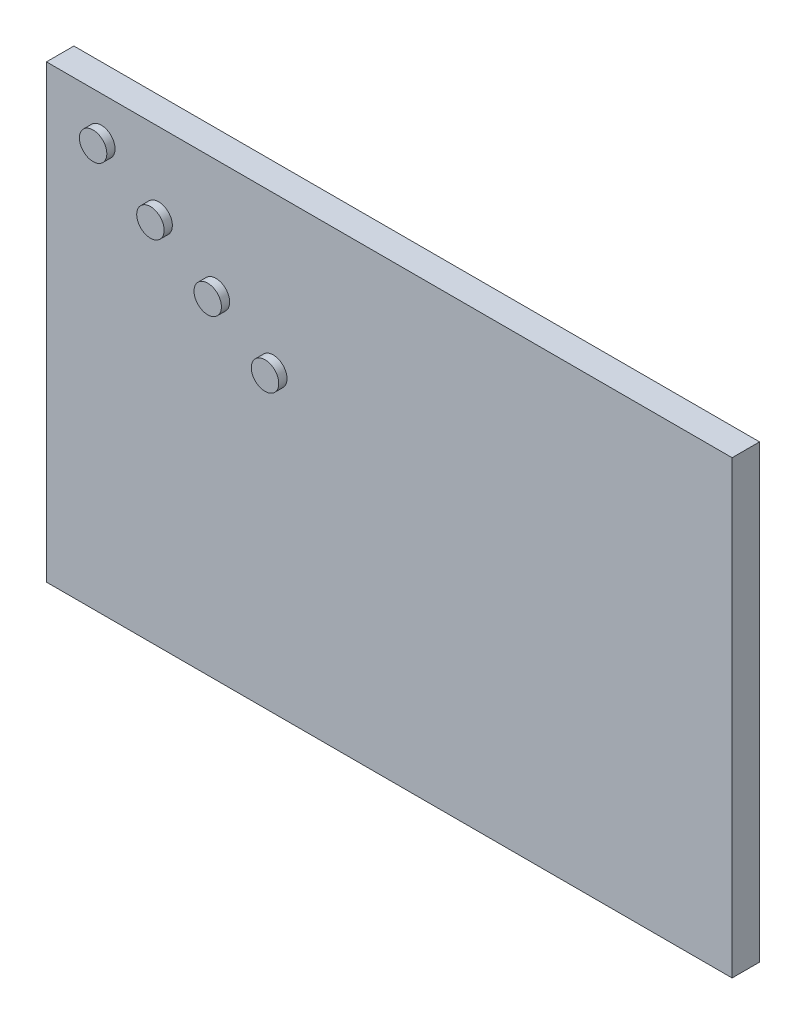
from build123d import *

# Parameters (mm, degrees)
SKIZZE1_W               = 2499.316337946
SKIZZE1_H               = 1642.496256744
LINEAR_AUSTRAGEN1_DEPTH = 100
SKIZZE2_R               = 50
LINEAR_AUSTRAGEN2_DEPTH = 30
LINEARES_MUSTER1_COUNT  = 4
LINEARES_MUSTER1_PITCH  = 250


with BuildPart() as part:
    # Skizze1 → Linear austragen1 (new body)
    with BuildSketch(Plane.XY):
        with Locations((1249.658168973, 821.248128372)):
            Rectangle(SKIZZE1_W, SKIZZE1_H)
    extrude(amount=-LINEAR_AUSTRAGEN1_DEPTH)


with BuildPart() as body_2:
    # Skizze2 → Linear austragen2 (new body)
    with BuildSketch(Plane.XY):
        with Locations((200, 1492.496256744)):
            Circle(SKIZZE2_R)
    linear_austragen2 = extrude(amount=LINEAR_AUSTRAGEN2_DEPTH)


with BuildPart() as part_1:
    add(part.part)

    # Lineares Muster1: Linear austragen2 ×4
    with Locations(*[Vector(0.8356919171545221, -0.5491985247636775, 0) * (i * LINEARES_MUSTER1_PITCH) for i in range(1, LINEARES_MUSTER1_COUNT)]):
        add(linear_austragen2)


solid = Compound([body_2.part, part_1.part])
